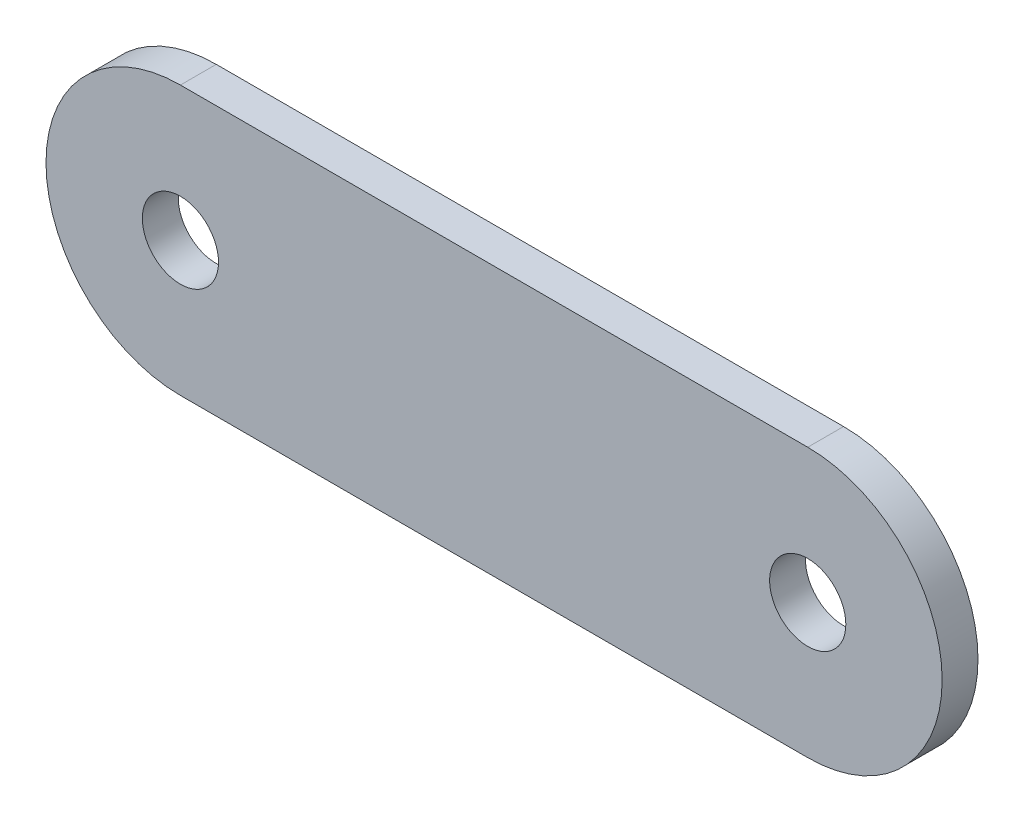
ISO-10303-21;
HEADER;
FILE_DESCRIPTION(('STEP AP214'),'2;1');
FILE_NAME('part.step','',(''),(''),'','','');
FILE_SCHEMA(('AUTOMOTIVE_DESIGN { 1 0 10303 214 1 1 1 1 }'));
ENDSEC;
DATA;
#1=APPLICATION_CONTEXT('core data for automotive mechanical design processes');
#2=APPLICATION_PROTOCOL_DEFINITION('international standard','automotive_design',2000,#1);
#3=PRODUCT_CONTEXT('',#1,'mechanical');
#4=PRODUCT('Part','Part','',(#3));
#5=PRODUCT_RELATED_PRODUCT_CATEGORY('part','',(#4));
#6=PRODUCT_DEFINITION_FORMATION('','',#4);
#7=PRODUCT_DEFINITION_CONTEXT('part definition',#1,'design');
#8=PRODUCT_DEFINITION('design','',#6,#7);
#9=PRODUCT_DEFINITION_SHAPE('','',#8);
#10=(LENGTH_UNIT() NAMED_UNIT(*) SI_UNIT(.MILLI.,.METRE.));
#11=(NAMED_UNIT(*) PLANE_ANGLE_UNIT() SI_UNIT($,.RADIAN.));
#12=(NAMED_UNIT(*) SI_UNIT($,.STERADIAN.) SOLID_ANGLE_UNIT());
#13=UNCERTAINTY_MEASURE_WITH_UNIT(LENGTH_MEASURE(1.E-05),#10,'distance_accuracy_value','');
#14=(GEOMETRIC_REPRESENTATION_CONTEXT(3) GLOBAL_UNCERTAINTY_ASSIGNED_CONTEXT((#13)) GLOBAL_UNIT_ASSIGNED_CONTEXT((#10,
#11,#12)) REPRESENTATION_CONTEXT('',''));
#15=CARTESIAN_POINT('',(0.,0.,0.));
#16=DIRECTION('',(0.,0.,1.));
#17=DIRECTION('',(1.,0.,0.));
#18=AXIS2_PLACEMENT_3D('',#15,#16,#17);
#19=CARTESIAN_POINT('',(0.,0.,2.));
#20=DIRECTION('',(0.,0.,1.));
#21=DIRECTION('',(1.,0.,0.));
#22=AXIS2_PLACEMENT_3D('',#19,#20,#21);
#23=PLANE('',#22);
#24=CARTESIAN_POINT('',(0.,0.,2.));
#25=DIRECTION('',(0.,0.,1.));
#26=DIRECTION('',(1.,0.,0.));
#27=AXIS2_PLACEMENT_3D('',#24,#25,#26);
#28=CIRCLE('',#27,2.125);
#29=CARTESIAN_POINT('',(2.125,0.,2.));
#30=VERTEX_POINT('',#29);
#31=EDGE_CURVE('E101',#30,#30,#28,.T.);
#32=ORIENTED_EDGE('',*,*,#31,.F.);
#33=EDGE_LOOP('',(#32));
#34=FACE_BOUND('',#33,.T.);
#35=CARTESIAN_POINT('',(0.,0.,2.));
#36=DIRECTION('',(0.,0.,1.));
#37=DIRECTION('',(1.,0.,0.));
#38=AXIS2_PLACEMENT_3D('',#35,#36,#37);
#39=CIRCLE('',#38,7.5);
#40=CARTESIAN_POINT('',(0.,7.5,2.));
#41=VERTEX_POINT('',#40);
#42=CARTESIAN_POINT('',(0.,-7.5,2.));
#43=VERTEX_POINT('',#42);
#44=EDGE_CURVE('E86',#41,#43,#39,.T.);
#45=ORIENTED_EDGE('',*,*,#44,.T.);
#46=DIRECTION('',(1.,0.,0.));
#47=VECTOR('',#46,1.);
#48=CARTESIAN_POINT('',(0.,-7.5,2.));
#49=LINE('',#48,#47);
#50=CARTESIAN_POINT('',(35.,-7.5,2.));
#51=VERTEX_POINT('',#50);
#52=EDGE_CURVE('E81',#43,#51,#49,.T.);
#53=ORIENTED_EDGE('',*,*,#52,.T.);
#54=CARTESIAN_POINT('',(35.,0.,2.));
#55=DIRECTION('',(0.,0.,1.));
#56=DIRECTION('',(1.,0.,0.));
#57=AXIS2_PLACEMENT_3D('',#54,#55,#56);
#58=CIRCLE('',#57,7.5);
#59=CARTESIAN_POINT('',(35.,7.5,2.));
#60=VERTEX_POINT('',#59);
#61=EDGE_CURVE('E84',#51,#60,#58,.T.);
#62=ORIENTED_EDGE('',*,*,#61,.T.);
#63=DIRECTION('',(-1.,0.,0.));
#64=VECTOR('',#63,1.);
#65=CARTESIAN_POINT('',(0.,7.5,2.));
#66=LINE('',#65,#64);
#67=EDGE_CURVE('E51',#60,#41,#66,.T.);
#68=ORIENTED_EDGE('',*,*,#67,.T.);
#69=EDGE_LOOP('',(#45,#53,#62,#68));
#70=FACE_BOUND('',#69,.T.);
#71=CARTESIAN_POINT('',(35.,0.,2.));
#72=DIRECTION('',(0.,0.,1.));
#73=DIRECTION('',(1.,0.,0.));
#74=AXIS2_PLACEMENT_3D('',#71,#72,#73);
#75=CIRCLE('',#74,2.125);
#76=CARTESIAN_POINT('',(37.125,0.,2.));
#77=VERTEX_POINT('',#76);
#78=EDGE_CURVE('E116',#77,#77,#75,.T.);
#79=ORIENTED_EDGE('',*,*,#78,.F.);
#80=EDGE_LOOP('',(#79));
#81=FACE_BOUND('',#80,.T.);
#82=ADVANCED_FACE('F34',(#34,#70,#81),#23,.T.);
#83=CARTESIAN_POINT('',(0.,0.,0.));
#84=DIRECTION('',(0.,0.,1.));
#85=DIRECTION('',(1.,0.,0.));
#86=AXIS2_PLACEMENT_3D('',#83,#84,#85);
#87=PLANE('',#86);
#88=CARTESIAN_POINT('',(0.,0.,0.));
#89=DIRECTION('',(0.,0.,1.));
#90=DIRECTION('',(1.,0.,0.));
#91=AXIS2_PLACEMENT_3D('',#88,#89,#90);
#92=CIRCLE('',#91,2.125);
#93=CARTESIAN_POINT('',(2.125,0.,0.));
#94=VERTEX_POINT('',#93);
#95=EDGE_CURVE('E113',#94,#94,#92,.T.);
#96=ORIENTED_EDGE('',*,*,#95,.T.);
#97=EDGE_LOOP('',(#96));
#98=FACE_BOUND('',#97,.T.);
#99=CARTESIAN_POINT('',(0.,0.,0.));
#100=DIRECTION('',(0.,0.,1.));
#101=DIRECTION('',(1.,0.,0.));
#102=AXIS2_PLACEMENT_3D('',#99,#100,#101);
#103=CIRCLE('',#102,7.5);
#104=CARTESIAN_POINT('',(0.,7.5,0.));
#105=VERTEX_POINT('',#104);
#106=CARTESIAN_POINT('',(0.,-7.5,0.));
#107=VERTEX_POINT('',#106);
#108=EDGE_CURVE('E98',#105,#107,#103,.T.);
#109=ORIENTED_EDGE('',*,*,#108,.F.);
#110=DIRECTION('',(-1.,0.,0.));
#111=VECTOR('',#110,1.);
#112=CARTESIAN_POINT('',(0.,7.5,0.));
#113=LINE('',#112,#111);
#114=CARTESIAN_POINT('',(35.,7.5,0.));
#115=VERTEX_POINT('',#114);
#116=EDGE_CURVE('E74',#115,#105,#113,.T.);
#117=ORIENTED_EDGE('',*,*,#116,.F.);
#118=CARTESIAN_POINT('',(35.,0.,0.));
#119=DIRECTION('',(0.,0.,1.));
#120=DIRECTION('',(1.,0.,0.));
#121=AXIS2_PLACEMENT_3D('',#118,#119,#120);
#122=CIRCLE('',#121,7.5);
#123=CARTESIAN_POINT('',(35.,-7.5,0.));
#124=VERTEX_POINT('',#123);
#125=EDGE_CURVE('E68',#124,#115,#122,.T.);
#126=ORIENTED_EDGE('',*,*,#125,.F.);
#127=DIRECTION('',(1.,0.,0.));
#128=VECTOR('',#127,1.);
#129=CARTESIAN_POINT('',(0.,-7.5,0.));
#130=LINE('',#129,#128);
#131=EDGE_CURVE('E90',#107,#124,#130,.T.);
#132=ORIENTED_EDGE('',*,*,#131,.F.);
#133=EDGE_LOOP('',(#109,#117,#126,#132));
#134=FACE_BOUND('',#133,.T.);
#135=CARTESIAN_POINT('',(35.,0.,0.));
#136=DIRECTION('',(0.,0.,1.));
#137=DIRECTION('',(1.,0.,0.));
#138=AXIS2_PLACEMENT_3D('',#135,#136,#137);
#139=CIRCLE('',#138,2.125);
#140=CARTESIAN_POINT('',(37.125,0.,0.));
#141=VERTEX_POINT('',#140);
#142=EDGE_CURVE('E119',#141,#141,#139,.T.);
#143=ORIENTED_EDGE('',*,*,#142,.T.);
#144=EDGE_LOOP('',(#143));
#145=FACE_BOUND('',#144,.T.);
#146=ADVANCED_FACE('F109',(#98,#134,#145),#87,.F.);
#147=CARTESIAN_POINT('',(0.,0.,2.));
#148=DIRECTION('',(0.,0.,-1.));
#149=DIRECTION('',(-1.,0.,0.));
#150=AXIS2_PLACEMENT_3D('',#147,#148,#149);
#151=CYLINDRICAL_SURFACE('',#150,7.5);
#152=ORIENTED_EDGE('',*,*,#108,.T.);
#153=DIRECTION('',(0.,0.,-1.));
#154=VECTOR('',#153,1.);
#155=CARTESIAN_POINT('',(0.,-7.5,2.));
#156=LINE('',#155,#154);
#157=EDGE_CURVE('E11',#43,#107,#156,.T.);
#158=ORIENTED_EDGE('',*,*,#157,.F.);
#159=ORIENTED_EDGE('',*,*,#44,.F.);
#160=DIRECTION('',(0.,0.,-1.));
#161=VECTOR('',#160,1.);
#162=CARTESIAN_POINT('',(0.,7.5,2.));
#163=LINE('',#162,#161);
#164=EDGE_CURVE('E94',#41,#105,#163,.T.);
#165=ORIENTED_EDGE('',*,*,#164,.T.);
#166=EDGE_LOOP('',(#152,#158,#159,#165));
#167=FACE_BOUND('',#166,.T.);
#168=ADVANCED_FACE('F36',(#167),#151,.T.);
#169=CARTESIAN_POINT('',(0.,-7.5,2.));
#170=DIRECTION('',(0.,1.,0.));
#171=DIRECTION('',(0.,0.,1.));
#172=AXIS2_PLACEMENT_3D('',#169,#170,#171);
#173=PLANE('',#172);
#174=ORIENTED_EDGE('',*,*,#131,.T.);
#175=DIRECTION('',(0.,0.,-1.));
#176=VECTOR('',#175,1.);
#177=CARTESIAN_POINT('',(35.,-7.5,2.));
#178=LINE('',#177,#176);
#179=EDGE_CURVE('E43',#51,#124,#178,.T.);
#180=ORIENTED_EDGE('',*,*,#179,.F.);
#181=ORIENTED_EDGE('',*,*,#52,.F.);
#182=ORIENTED_EDGE('',*,*,#157,.T.);
#183=EDGE_LOOP('',(#174,#180,#181,#182));
#184=FACE_BOUND('',#183,.T.);
#185=ADVANCED_FACE('F89',(#184),#173,.F.);
#186=CARTESIAN_POINT('',(35.,0.,2.));
#187=DIRECTION('',(0.,0.,-1.));
#188=DIRECTION('',(-1.,0.,0.));
#189=AXIS2_PLACEMENT_3D('',#186,#187,#188);
#190=CYLINDRICAL_SURFACE('',#189,7.5);
#191=ORIENTED_EDGE('',*,*,#125,.T.);
#192=DIRECTION('',(0.,0.,-1.));
#193=VECTOR('',#192,1.);
#194=CARTESIAN_POINT('',(35.,7.5,2.));
#195=LINE('',#194,#193);
#196=EDGE_CURVE('E91',#60,#115,#195,.T.);
#197=ORIENTED_EDGE('',*,*,#196,.F.);
#198=ORIENTED_EDGE('',*,*,#61,.F.);
#199=ORIENTED_EDGE('',*,*,#179,.T.);
#200=EDGE_LOOP('',(#191,#197,#198,#199));
#201=FACE_BOUND('',#200,.T.);
#202=ADVANCED_FACE('F92',(#201),#190,.T.);
#203=CARTESIAN_POINT('',(0.,7.5,2.));
#204=DIRECTION('',(0.,-1.,0.));
#205=DIRECTION('',(0.,0.,-1.));
#206=AXIS2_PLACEMENT_3D('',#203,#204,#205);
#207=PLANE('',#206);
#208=ORIENTED_EDGE('',*,*,#116,.T.);
#209=ORIENTED_EDGE('',*,*,#164,.F.);
#210=ORIENTED_EDGE('',*,*,#67,.F.);
#211=ORIENTED_EDGE('',*,*,#196,.T.);
#212=EDGE_LOOP('',(#208,#209,#210,#211));
#213=FACE_BOUND('',#212,.T.);
#214=ADVANCED_FACE('F106',(#213),#207,.F.);
#215=CARTESIAN_POINT('',(0.,0.,2.));
#216=DIRECTION('',(0.,0.,-1.));
#217=DIRECTION('',(-1.,0.,0.));
#218=AXIS2_PLACEMENT_3D('',#215,#216,#217);
#219=CYLINDRICAL_SURFACE('',#218,2.125);
#220=ORIENTED_EDGE('',*,*,#31,.T.);
#221=EDGE_LOOP('',(#220));
#222=FACE_BOUND('',#221,.T.);
#223=ORIENTED_EDGE('',*,*,#95,.F.);
#224=EDGE_LOOP('',(#223));
#225=FACE_BOUND('',#224,.T.);
#226=ADVANCED_FACE('F137',(#222,#225),#219,.F.);
#227=CARTESIAN_POINT('',(35.,0.,2.));
#228=DIRECTION('',(0.,0.,-1.));
#229=DIRECTION('',(-1.,0.,0.));
#230=AXIS2_PLACEMENT_3D('',#227,#228,#229);
#231=CYLINDRICAL_SURFACE('',#230,2.125);
#232=ORIENTED_EDGE('',*,*,#78,.T.);
#233=EDGE_LOOP('',(#232));
#234=FACE_BOUND('',#233,.T.);
#235=ORIENTED_EDGE('',*,*,#142,.F.);
#236=EDGE_LOOP('',(#235));
#237=FACE_BOUND('',#236,.T.);
#238=ADVANCED_FACE('F125',(#234,#237),#231,.F.);
#239=CLOSED_SHELL('',(#82,#146,#168,#185,#202,#214,#226,#238));
#240=MANIFOLD_SOLID_BREP('B2',#239);
#241=ADVANCED_BREP_SHAPE_REPRESENTATION('',(#18,#240),#14);
#242=SHAPE_DEFINITION_REPRESENTATION(#9,#241);
ENDSEC;
END-ISO-10303-21;
